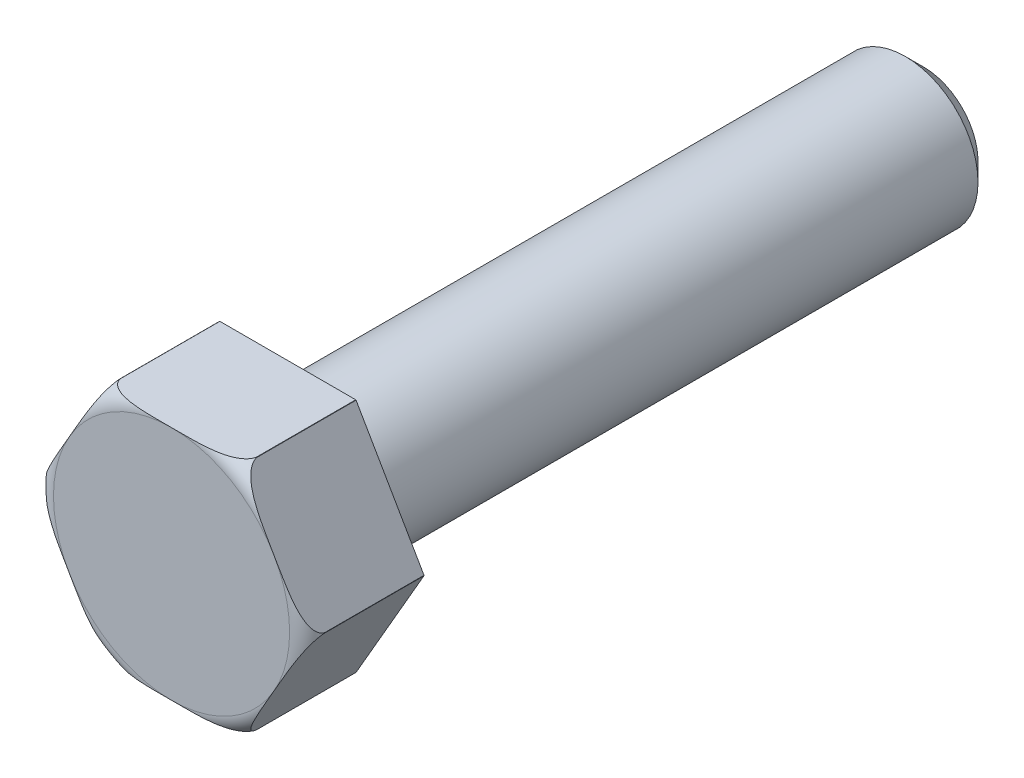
from build123d import *

# Parameters (mm, degrees)
ESQUISSE1_R             = 7.5
EXTRUSION1_DEPTH        = 6.4
CONG_1_R                = 1
ESQUISSE2_R             = 14.142135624
ENL_V_MAT_EXTRU_1_DEPTH = 13.38789738
ESQUISSE3_R             = 4
EXTRUSION2_DEPTH        = 35
CHANFREIN1_SIZE         = 1


with BuildPart() as part:
    # Esquisse1 → Extrusion1 (new body)
    with BuildSketch(Plane.XY):
        Circle(ESQUISSE1_R)
    extrude(amount=EXTRUSION1_DEPTH)

    # Cong_1
    cong_1_edges = [part.edges().sort_by_distance(p)[0] for p in [
        (-7.5, 0, 6.4),
    ]]
    fillet(cong_1_edges, radius=CONG_1_R)

    # Esquisse2 → Enl_v. mat.-Extru.1 (cut, through all)
    with BuildSketch(Plane.XY.offset(6.4)):
        Circle(ESQUISSE2_R)
        Polygon((7.505553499, 0), (3.75277675, 6.5), (-3.75277675, 6.5), (-7.505553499, 0), (-3.75277675, -6.5), (3.75277675, -6.5), align=None, mode=Mode.SUBTRACT)
    extrude(amount=-ENL_V_MAT_EXTRU_1_DEPTH, mode=Mode.SUBTRACT)

    # Esquisse3 → Extrusion2 (add)
    with BuildSketch(Plane(origin=(0, 0, 0), x_dir=(-1, 0, 0), z_dir=(0, 0, -1))):
        with Locations(Location((0, 0, 0), (0, 0, 180))):
            Circle(ESQUISSE3_R)
    extrude(amount=EXTRUSION2_DEPTH)

    # Chanfrein1
    chanfrein1_edges = [part.edges().sort_by_distance(p)[0] for p in [
        (-4, 0, -35),
    ]]
    chamfer(chanfrein1_edges, length=CHANFREIN1_SIZE)


solid = part.part
